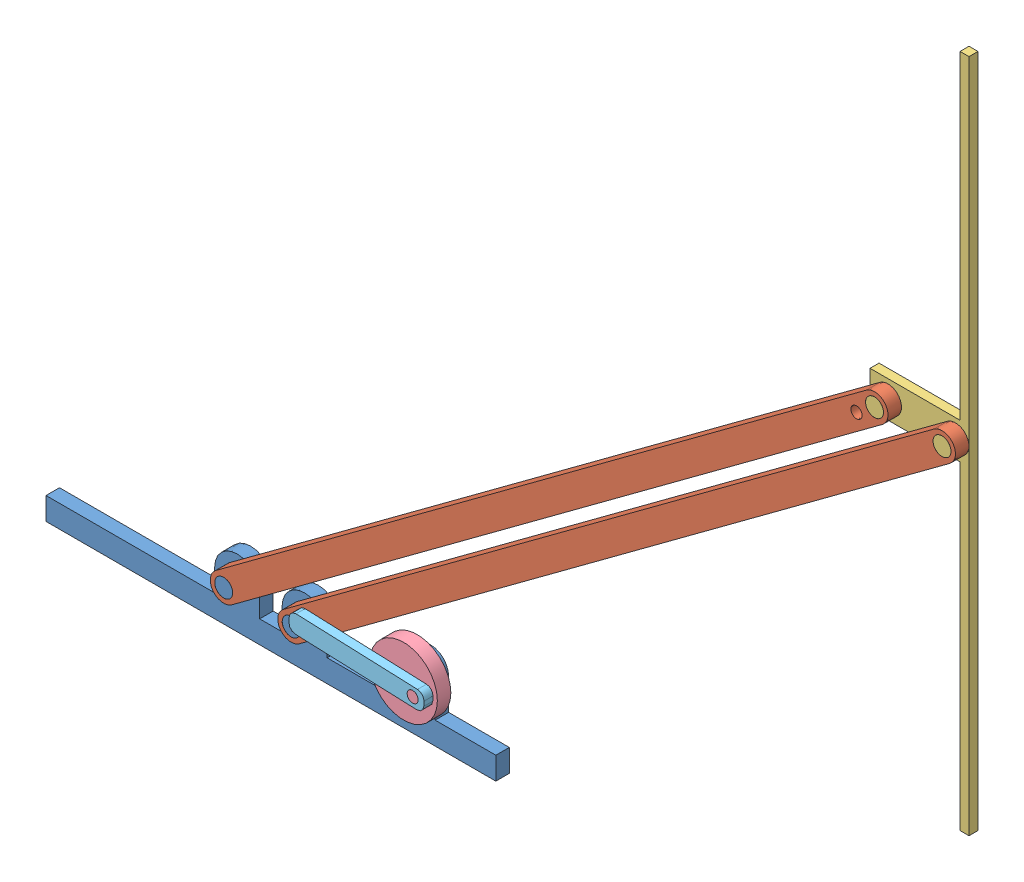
SolidWorks assembly Essuie-glace_de_bus.SLDASM, configuration Default (file format 4700). Lengths in mm.
Overall size (2063.8 1920.82 80).
6 component instances, 5 part files, 12 mates.
Components (placement in the parent):
- Bati-1: Bati.SLDPRT [Default] at (-525.4724 10.2235 -30) size (1000 160 60)
- Bielle-1: Bielle.SLDPRT [Default] at (1478.5207 1155.1568 0) x (-0.8038 -0.5949 0) z (0 0 1) size (1860 60 30)
- Bielle-2: Bielle.SLDPRT [Default] at (-82.6254 36.1095 0) x (0.8038 0.5949 0) z (0 0 1) size (1860 60 30)
- Ballai-1: Ballai.SLDPRT [Default] at (1306.3677 1091.0428 -20) size (220 1500 50)
- Manivelle-1: Manivelle.SLDPRT [Défaut] at (-415.4724 40.2235 0) size (150 150 80)
- Biellette-1: Biellette.SLDPRT [Défaut] at (1077.2797 88.567 30) x (-0.99924 0.03898 0) z (0 0 1) size (300 40 40)
Mates (geometry in assembly coordinates):
- Coaxial1: concentric: cylinder of Bati-1 through (-100.4724 60.2235 30) axis (0 0 -1) radius 20; cylinder of Bielle-2 through (-100.4724 60.2235 30) axis (0 0 -1) radius 20
- Coïncidente1: coincident: plane of Bati-1 through (-100.4724 60.2235 0) normal (0 0 1); plane of Bielle-2 through (-100.4724 60.2235 0) normal (0 0 -1)
- Coaxial2: concentric: cylinder of Bati-1 through (49.5276 60.2235 30) axis (0 0 -1) radius 20; cylinder of Bielle-1 through (49.5276 60.2235 30) axis (0 0 -1) radius 20
- Coïncidente2: coincident: plane of Bati-1 through (-100.4724 60.2235 0) normal (0 0 1); plane of Bielle-1 through (1496.3677 1131.0428 0) normal (0 0 -1)
- Coaxial3: concentric: cylinder of Bielle-2 through (1346.3677 1131.0428 30) axis (0 0 -1) radius 20; cylinder of Ballai-1 through (1346.3677 1131.0428 30) axis (0 0 -1) radius 20
- Coaxial4: concentric: cylinder of Bielle-1 through (1496.3677 1131.0428 30) axis (0 0 -1) radius 20; cylinder of Ballai-1 through (1496.3677 1131.0428 30) axis (0 0 -1) radius 20
- Coïncidente3: coincident: plane of Bielle-2 through (-100.4724 60.2235 0) normal (0 0 -1); plane of Ballai-1 through (1306.3677 1171.0428 0) normal (0 0 1)
- Coaxial5: concentric: cylinder of Bati-1 through (299.5276 80.2235 -30) axis (0 0 1) radius 15; cylinder of Manivelle-1 through (299.5276 80.2235 -30) axis (0 0 1) radius 15
- Coïncidente10: coincident: plane of Bati-1 through (-100.4724 60.2235 0) normal (0 0 1); plane of Manivelle-1 through (299.5276 80.2235 0) normal (0 0 -1)
- Coaxial6: concentric: cylinder of Manivelle-1 through (339.5276 80.2235 50) axis (0 0 -1) radius 12.5; cylinder of Biellette-1 through (339.5276 80.2235 30) axis (0 0 1) radius 12.5
- Coïncidente11: coincident: plane of Manivelle-1 through (299.5276 80.2235 30) normal (0 0 1); plane of Biellette-1 through (79.5303 85.3621 30) normal (0 0 -1)
- Coaxial7: concentric: cylinder of Bielle-1 through (89.7176 89.9685 0) axis (0 0 1) radius 12.5; cylinder of Biellette-1 through (89.7176 89.9685 10) axis (0 0 1) radius 12.5
